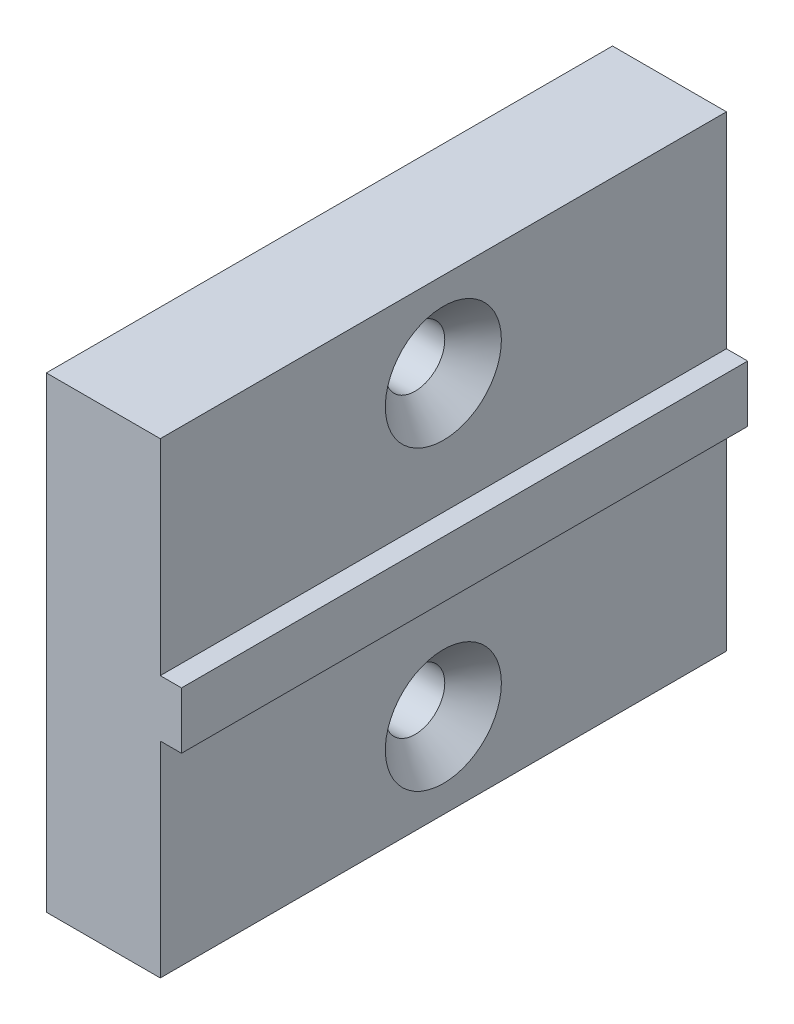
ISO-10303-21;
HEADER;
FILE_DESCRIPTION(('STEP AP214'),'2;1');
FILE_NAME('part.step','',(''),(''),'','','');
FILE_SCHEMA(('AUTOMOTIVE_DESIGN { 1 0 10303 214 1 1 1 1 }'));
ENDSEC;
DATA;
#1=APPLICATION_CONTEXT('core data for automotive mechanical design processes');
#2=APPLICATION_PROTOCOL_DEFINITION('international standard','automotive_design',2000,#1);
#3=PRODUCT_CONTEXT('',#1,'mechanical');
#4=PRODUCT('Part','Part','',(#3));
#5=PRODUCT_RELATED_PRODUCT_CATEGORY('part','',(#4));
#6=PRODUCT_DEFINITION_FORMATION('','',#4);
#7=PRODUCT_DEFINITION_CONTEXT('part definition',#1,'design');
#8=PRODUCT_DEFINITION('design','',#6,#7);
#9=PRODUCT_DEFINITION_SHAPE('','',#8);
#10=(LENGTH_UNIT() NAMED_UNIT(*) SI_UNIT(.MILLI.,.METRE.));
#11=(NAMED_UNIT(*) PLANE_ANGLE_UNIT() SI_UNIT($,.RADIAN.));
#12=(NAMED_UNIT(*) SI_UNIT($,.STERADIAN.) SOLID_ANGLE_UNIT());
#13=UNCERTAINTY_MEASURE_WITH_UNIT(LENGTH_MEASURE(1.E-05),#10,'distance_accuracy_value','');
#14=(GEOMETRIC_REPRESENTATION_CONTEXT(3) GLOBAL_UNCERTAINTY_ASSIGNED_CONTEXT((#13)) GLOBAL_UNIT_ASSIGNED_CONTEXT((#10,
#11,#12)) REPRESENTATION_CONTEXT('',''));
#15=CARTESIAN_POINT('',(0.,0.,0.));
#16=DIRECTION('',(0.,0.,1.));
#17=DIRECTION('',(1.,0.,0.));
#18=AXIS2_PLACEMENT_3D('',#15,#16,#17);
#19=CARTESIAN_POINT('',(0.,-16.5,0.));
#20=DIRECTION('',(0.,-1.,0.));
#21=DIRECTION('',(0.,0.,-1.));
#22=AXIS2_PLACEMENT_3D('',#19,#20,#21);
#23=PLANE('',#22);
#24=DIRECTION('',(0.,0.,-1.));
#25=VECTOR('',#24,1.);
#26=CARTESIAN_POINT('',(8.05,-16.5,0.));
#27=LINE('',#26,#25);
#28=CARTESIAN_POINT('',(8.05,-16.5,0.));
#29=VERTEX_POINT('',#28);
#30=CARTESIAN_POINT('',(8.05,-16.5,-40.));
#31=VERTEX_POINT('',#30);
#32=EDGE_CURVE('E136',#29,#31,#27,.T.);
#33=ORIENTED_EDGE('',*,*,#32,.F.);
#34=DIRECTION('',(1.,0.,0.));
#35=VECTOR('',#34,1.);
#36=CARTESIAN_POINT('',(0.,-16.5,0.));
#37=LINE('',#36,#35);
#38=CARTESIAN_POINT('',(0.,-16.5,0.));
#39=VERTEX_POINT('',#38);
#40=EDGE_CURVE('E162',#39,#29,#37,.T.);
#41=ORIENTED_EDGE('',*,*,#40,.F.);
#42=DIRECTION('',(0.,0.,-1.));
#43=VECTOR('',#42,1.);
#44=CARTESIAN_POINT('',(0.,-16.5,0.));
#45=LINE('',#44,#43);
#46=CARTESIAN_POINT('',(0.,-16.5,-40.));
#47=VERTEX_POINT('',#46);
#48=EDGE_CURVE('E146',#39,#47,#45,.T.);
#49=ORIENTED_EDGE('',*,*,#48,.T.);
#50=DIRECTION('',(1.,0.,0.));
#51=VECTOR('',#50,1.);
#52=CARTESIAN_POINT('',(0.,-16.5,-40.));
#53=LINE('',#52,#51);
#54=EDGE_CURVE('E158',#47,#31,#53,.T.);
#55=ORIENTED_EDGE('',*,*,#54,.T.);
#56=EDGE_LOOP('',(#33,#41,#49,#55));
#57=FACE_BOUND('',#56,.T.);
#58=ADVANCED_FACE('F35',(#57),#23,.T.);
#59=CARTESIAN_POINT('',(0.,16.5,0.));
#60=DIRECTION('',(0.,0.,1.));
#61=DIRECTION('',(1.,0.,0.));
#62=AXIS2_PLACEMENT_3D('',#59,#60,#61);
#63=PLANE('',#62);
#64=DIRECTION('',(0.,1.,0.));
#65=VECTOR('',#64,1.);
#66=CARTESIAN_POINT('',(8.05000000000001,2.,0.));
#67=LINE('',#66,#65);
#68=CARTESIAN_POINT('',(8.05000000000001,2.,0.));
#69=VERTEX_POINT('',#68);
#70=CARTESIAN_POINT('',(8.05,16.5,0.));
#71=VERTEX_POINT('',#70);
#72=EDGE_CURVE('E110',#69,#71,#67,.T.);
#73=ORIENTED_EDGE('',*,*,#72,.T.);
#74=DIRECTION('',(1.,0.,0.));
#75=VECTOR('',#74,1.);
#76=CARTESIAN_POINT('',(0.,16.5,0.));
#77=LINE('',#76,#75);
#78=CARTESIAN_POINT('',(0.,16.5,0.));
#79=VERTEX_POINT('',#78);
#80=EDGE_CURVE('E166',#79,#71,#77,.T.);
#81=ORIENTED_EDGE('',*,*,#80,.F.);
#82=DIRECTION('',(0.,-1.,0.));
#83=VECTOR('',#82,1.);
#84=CARTESIAN_POINT('',(0.,16.5,0.));
#85=LINE('',#84,#83);
#86=EDGE_CURVE('E155',#79,#39,#85,.T.);
#87=ORIENTED_EDGE('',*,*,#86,.T.);
#88=ORIENTED_EDGE('',*,*,#40,.T.);
#89=DIRECTION('',(0.,1.,0.));
#90=VECTOR('',#89,1.);
#91=CARTESIAN_POINT('',(8.05,-16.5,0.));
#92=LINE('',#91,#90);
#93=CARTESIAN_POINT('',(8.05,-2.,0.));
#94=VERTEX_POINT('',#93);
#95=EDGE_CURVE('E131',#29,#94,#92,.T.);
#96=ORIENTED_EDGE('',*,*,#95,.T.);
#97=DIRECTION('',(1.,0.,0.));
#98=VECTOR('',#97,1.);
#99=CARTESIAN_POINT('',(8.05,-2.,0.));
#100=LINE('',#99,#98);
#101=CARTESIAN_POINT('',(9.55,-2.,0.));
#102=VERTEX_POINT('',#101);
#103=EDGE_CURVE('E134',#94,#102,#100,.T.);
#104=ORIENTED_EDGE('',*,*,#103,.T.);
#105=DIRECTION('',(0.,-1.,0.));
#106=VECTOR('',#105,1.);
#107=CARTESIAN_POINT('',(9.55,16.5,0.));
#108=LINE('',#107,#106);
#109=CARTESIAN_POINT('',(9.55,2.,0.));
#110=VERTEX_POINT('',#109);
#111=EDGE_CURVE('E119',#110,#102,#108,.T.);
#112=ORIENTED_EDGE('',*,*,#111,.F.);
#113=DIRECTION('',(-1.,0.,0.));
#114=VECTOR('',#113,1.);
#115=CARTESIAN_POINT('',(9.55,2.,0.));
#116=LINE('',#115,#114);
#117=EDGE_CURVE('E50',#110,#69,#116,.T.);
#118=ORIENTED_EDGE('',*,*,#117,.T.);
#119=EDGE_LOOP('',(#73,#81,#87,#88,#96,#104,#112,#118));
#120=FACE_BOUND('',#119,.T.);
#121=ADVANCED_FACE('F117',(#120),#63,.T.);
#122=CARTESIAN_POINT('',(0.,16.5,-40.));
#123=DIRECTION('',(0.,1.,0.));
#124=DIRECTION('',(0.,0.,1.));
#125=AXIS2_PLACEMENT_3D('',#122,#123,#124);
#126=PLANE('',#125);
#127=DIRECTION('',(0.,0.,-1.));
#128=VECTOR('',#127,1.);
#129=CARTESIAN_POINT('',(8.05,16.5,0.));
#130=LINE('',#129,#128);
#131=CARTESIAN_POINT('',(8.05,16.5,-40.));
#132=VERTEX_POINT('',#131);
#133=EDGE_CURVE('E106',#71,#132,#130,.T.);
#134=ORIENTED_EDGE('',*,*,#133,.T.);
#135=DIRECTION('',(1.,0.,0.));
#136=VECTOR('',#135,1.);
#137=CARTESIAN_POINT('',(0.,16.5,-40.));
#138=LINE('',#137,#136);
#139=CARTESIAN_POINT('',(0.,16.5,-40.));
#140=VERTEX_POINT('',#139);
#141=EDGE_CURVE('E168',#140,#132,#138,.T.);
#142=ORIENTED_EDGE('',*,*,#141,.F.);
#143=DIRECTION('',(0.,0.,1.));
#144=VECTOR('',#143,1.);
#145=CARTESIAN_POINT('',(0.,16.5,-40.));
#146=LINE('',#145,#144);
#147=EDGE_CURVE('E152',#140,#79,#146,.T.);
#148=ORIENTED_EDGE('',*,*,#147,.T.);
#149=ORIENTED_EDGE('',*,*,#80,.T.);
#150=EDGE_LOOP('',(#134,#142,#148,#149));
#151=FACE_BOUND('',#150,.T.);
#152=ADVANCED_FACE('F197',(#151),#126,.T.);
#153=CARTESIAN_POINT('',(0.,-16.5,-40.));
#154=DIRECTION('',(0.,0.,-1.));
#155=DIRECTION('',(-1.,0.,0.));
#156=AXIS2_PLACEMENT_3D('',#153,#154,#155);
#157=PLANE('',#156);
#158=DIRECTION('',(0.,1.,0.));
#159=VECTOR('',#158,1.);
#160=CARTESIAN_POINT('',(8.05000000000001,2.,-40.));
#161=LINE('',#160,#159);
#162=CARTESIAN_POINT('',(8.05000000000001,2.,-40.));
#163=VERTEX_POINT('',#162);
#164=EDGE_CURVE('E120',#163,#132,#161,.T.);
#165=ORIENTED_EDGE('',*,*,#164,.F.);
#166=DIRECTION('',(-1.,0.,0.));
#167=VECTOR('',#166,1.);
#168=CARTESIAN_POINT('',(9.55,2.,-40.));
#169=LINE('',#168,#167);
#170=CARTESIAN_POINT('',(9.55,2.,-40.));
#171=VERTEX_POINT('',#170);
#172=EDGE_CURVE('E103',#171,#163,#169,.T.);
#173=ORIENTED_EDGE('',*,*,#172,.F.);
#174=DIRECTION('',(0.,1.,0.));
#175=VECTOR('',#174,1.);
#176=CARTESIAN_POINT('',(9.55,-16.5,-40.));
#177=LINE('',#176,#175);
#178=CARTESIAN_POINT('',(9.55,-2.,-40.));
#179=VERTEX_POINT('',#178);
#180=EDGE_CURVE('E142',#179,#171,#177,.T.);
#181=ORIENTED_EDGE('',*,*,#180,.F.);
#182=DIRECTION('',(1.,0.,0.));
#183=VECTOR('',#182,1.);
#184=CARTESIAN_POINT('',(8.05,-2.,-40.));
#185=LINE('',#184,#183);
#186=CARTESIAN_POINT('',(8.05,-2.,-40.));
#187=VERTEX_POINT('',#186);
#188=EDGE_CURVE('E58',#187,#179,#185,.T.);
#189=ORIENTED_EDGE('',*,*,#188,.F.);
#190=DIRECTION('',(0.,1.,0.));
#191=VECTOR('',#190,1.);
#192=CARTESIAN_POINT('',(8.05,-16.5,-40.));
#193=LINE('',#192,#191);
#194=EDGE_CURVE('E128',#31,#187,#193,.T.);
#195=ORIENTED_EDGE('',*,*,#194,.F.);
#196=ORIENTED_EDGE('',*,*,#54,.F.);
#197=DIRECTION('',(0.,1.,0.));
#198=VECTOR('',#197,1.);
#199=CARTESIAN_POINT('',(0.,-16.5,-40.));
#200=LINE('',#199,#198);
#201=EDGE_CURVE('E149',#47,#140,#200,.T.);
#202=ORIENTED_EDGE('',*,*,#201,.T.);
#203=ORIENTED_EDGE('',*,*,#141,.T.);
#204=EDGE_LOOP('',(#165,#173,#181,#189,#195,#196,#202,#203));
#205=FACE_BOUND('',#204,.T.);
#206=ADVANCED_FACE('F201',(#205),#157,.T.);
#207=CARTESIAN_POINT('',(0.,0.,0.));
#208=DIRECTION('',(1.,0.,0.));
#209=DIRECTION('',(0.,0.,-1.));
#210=AXIS2_PLACEMENT_3D('',#207,#208,#209);
#211=PLANE('',#210);
#212=CARTESIAN_POINT('',(0.,-10.5,-20.));
#213=DIRECTION('',(1.,0.,0.));
#214=DIRECTION('',(0.,0.,-1.));
#215=AXIS2_PLACEMENT_3D('',#212,#213,#214);
#216=CIRCLE('',#215,2.1);
#217=CARTESIAN_POINT('',(0.,-10.5,-22.1));
#218=VERTEX_POINT('',#217);
#219=EDGE_CURVE('E318',#218,#218,#216,.T.);
#220=ORIENTED_EDGE('',*,*,#219,.T.);
#221=EDGE_LOOP('',(#220));
#222=FACE_BOUND('',#221,.T.);
#223=CARTESIAN_POINT('',(0.,10.5,-20.));
#224=DIRECTION('',(1.,0.,0.));
#225=DIRECTION('',(0.,0.,-1.));
#226=AXIS2_PLACEMENT_3D('',#223,#224,#225);
#227=CIRCLE('',#226,2.1);
#228=CARTESIAN_POINT('',(0.,10.5,-22.1));
#229=VERTEX_POINT('',#228);
#230=EDGE_CURVE('E124',#229,#229,#227,.T.);
#231=ORIENTED_EDGE('',*,*,#230,.T.);
#232=EDGE_LOOP('',(#231));
#233=FACE_BOUND('',#232,.T.);
#234=ORIENTED_EDGE('',*,*,#48,.F.);
#235=ORIENTED_EDGE('',*,*,#86,.F.);
#236=ORIENTED_EDGE('',*,*,#147,.F.);
#237=ORIENTED_EDGE('',*,*,#201,.F.);
#238=EDGE_LOOP('',(#234,#235,#236,#237));
#239=FACE_BOUND('',#238,.T.);
#240=ADVANCED_FACE('F204',(#222,#233,#239),#211,.F.);
#241=CARTESIAN_POINT('',(9.55,0.,0.));
#242=DIRECTION('',(1.,0.,0.));
#243=DIRECTION('',(0.,0.,-1.));
#244=AXIS2_PLACEMENT_3D('',#241,#242,#243);
#245=PLANE('',#244);
#246=DIRECTION('',(0.,0.,-1.));
#247=VECTOR('',#246,1.);
#248=CARTESIAN_POINT('',(9.55,2.,0.));
#249=LINE('',#248,#247);
#250=EDGE_CURVE('E107',#110,#171,#249,.T.);
#251=ORIENTED_EDGE('',*,*,#250,.F.);
#252=ORIENTED_EDGE('',*,*,#111,.T.);
#253=DIRECTION('',(0.,0.,-1.));
#254=VECTOR('',#253,1.);
#255=CARTESIAN_POINT('',(9.55,-2.,0.));
#256=LINE('',#255,#254);
#257=EDGE_CURVE('E140',#102,#179,#256,.T.);
#258=ORIENTED_EDGE('',*,*,#257,.T.);
#259=ORIENTED_EDGE('',*,*,#180,.T.);
#260=EDGE_LOOP('',(#251,#252,#258,#259));
#261=FACE_BOUND('',#260,.T.);
#262=ADVANCED_FACE('F209',(#261),#245,.T.);
#263=CARTESIAN_POINT('',(8.05,-2.,0.));
#264=DIRECTION('',(0.,1.,0.));
#265=DIRECTION('',(0.,0.,1.));
#266=AXIS2_PLACEMENT_3D('',#263,#264,#265);
#267=PLANE('',#266);
#268=ORIENTED_EDGE('',*,*,#188,.T.);
#269=ORIENTED_EDGE('',*,*,#257,.F.);
#270=ORIENTED_EDGE('',*,*,#103,.F.);
#271=DIRECTION('',(0.,0.,-1.));
#272=VECTOR('',#271,1.);
#273=CARTESIAN_POINT('',(8.05,-2.,0.));
#274=LINE('',#273,#272);
#275=EDGE_CURVE('E143',#94,#187,#274,.T.);
#276=ORIENTED_EDGE('',*,*,#275,.T.);
#277=EDGE_LOOP('',(#268,#269,#270,#276));
#278=FACE_BOUND('',#277,.T.);
#279=ADVANCED_FACE('F212',(#278),#267,.F.);
#280=CARTESIAN_POINT('',(8.05,-16.5,0.));
#281=DIRECTION('',(-1.,0.,0.));
#282=DIRECTION('',(0.,0.,1.));
#283=AXIS2_PLACEMENT_3D('',#280,#281,#282);
#284=PLANE('',#283);
#285=CARTESIAN_POINT('',(8.05,-10.5,-20.));
#286=DIRECTION('',(-1.,0.,0.));
#287=DIRECTION('',(0.,0.,1.));
#288=AXIS2_PLACEMENT_3D('',#285,#286,#287);
#289=CIRCLE('',#288,4.09999999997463);
#290=CARTESIAN_POINT('',(8.05000000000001,-10.5,-24.0999999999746));
#291=VERTEX_POINT('',#290);
#292=EDGE_CURVE('E11',#291,#291,#289,.T.);
#293=ORIENTED_EDGE('',*,*,#292,.T.);
#294=EDGE_LOOP('',(#293));
#295=FACE_BOUND('',#294,.T.);
#296=ORIENTED_EDGE('',*,*,#194,.T.);
#297=ORIENTED_EDGE('',*,*,#275,.F.);
#298=ORIENTED_EDGE('',*,*,#95,.F.);
#299=ORIENTED_EDGE('',*,*,#32,.T.);
#300=EDGE_LOOP('',(#296,#297,#298,#299));
#301=FACE_BOUND('',#300,.T.);
#302=ADVANCED_FACE('F217',(#295,#301),#284,.F.);
#303=CARTESIAN_POINT('',(8.05000000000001,2.,0.));
#304=DIRECTION('',(-1.,0.,0.));
#305=DIRECTION('',(0.,-1.,0.));
#306=AXIS2_PLACEMENT_3D('',#303,#304,#305);
#307=PLANE('',#306);
#308=CARTESIAN_POINT('',(8.05,10.5,-20.));
#309=DIRECTION('',(-1.,0.,0.));
#310=DIRECTION('',(0.,-1.,0.));
#311=AXIS2_PLACEMENT_3D('',#308,#309,#310);
#312=CIRCLE('',#311,4.09999999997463);
#313=CARTESIAN_POINT('',(8.05,6.40000000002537,-20.));
#314=VERTEX_POINT('',#313);
#315=EDGE_CURVE('E175',#314,#314,#312,.T.);
#316=ORIENTED_EDGE('',*,*,#315,.T.);
#317=EDGE_LOOP('',(#316));
#318=FACE_BOUND('',#317,.T.);
#319=ORIENTED_EDGE('',*,*,#164,.T.);
#320=ORIENTED_EDGE('',*,*,#133,.F.);
#321=ORIENTED_EDGE('',*,*,#72,.F.);
#322=DIRECTION('',(0.,0.,-1.));
#323=VECTOR('',#322,1.);
#324=CARTESIAN_POINT('',(8.05000000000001,2.,0.));
#325=LINE('',#324,#323);
#326=EDGE_CURVE('E99',#69,#163,#325,.T.);
#327=ORIENTED_EDGE('',*,*,#326,.T.);
#328=EDGE_LOOP('',(#319,#320,#321,#327));
#329=FACE_BOUND('',#328,.T.);
#330=ADVANCED_FACE('F111',(#318,#329),#307,.F.);
#331=CARTESIAN_POINT('',(9.55,2.,0.));
#332=DIRECTION('',(0.,-1.,0.));
#333=DIRECTION('',(1.,0.,0.));
#334=AXIS2_PLACEMENT_3D('',#331,#332,#333);
#335=PLANE('',#334);
#336=ORIENTED_EDGE('',*,*,#172,.T.);
#337=ORIENTED_EDGE('',*,*,#326,.F.);
#338=ORIENTED_EDGE('',*,*,#117,.F.);
#339=ORIENTED_EDGE('',*,*,#250,.T.);
#340=EDGE_LOOP('',(#336,#337,#338,#339));
#341=FACE_BOUND('',#340,.T.);
#342=ADVANCED_FACE('F101',(#341),#335,.F.);
#343=CARTESIAN_POINT('',(8.05,10.5,-20.));
#344=DIRECTION('',(1.,0.,0.));
#345=DIRECTION('',(0.,0.,-1.));
#346=AXIS2_PLACEMENT_3D('',#343,#344,#345);
#347=CYLINDRICAL_SURFACE('',#346,2.1);
#348=CARTESIAN_POINT('',(6.05000000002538,10.5,-20.));
#349=DIRECTION('',(-1.,0.,0.));
#350=DIRECTION('',(0.,0.,1.));
#351=AXIS2_PLACEMENT_3D('',#348,#349,#350);
#352=CIRCLE('',#351,2.1);
#353=CARTESIAN_POINT('',(6.05000000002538,10.5,-17.9));
#354=VERTEX_POINT('',#353);
#355=EDGE_CURVE('E165',#354,#354,#352,.F.);
#356=ORIENTED_EDGE('',*,*,#355,.T.);
#357=EDGE_LOOP('',(#356));
#358=FACE_BOUND('',#357,.T.);
#359=ORIENTED_EDGE('',*,*,#230,.F.);
#360=EDGE_LOOP('',(#359));
#361=FACE_BOUND('',#360,.T.);
#362=ADVANCED_FACE('F225',(#358,#361),#347,.F.);
#363=CARTESIAN_POINT('',(8.05,-10.5,-20.));
#364=DIRECTION('',(1.,0.,0.));
#365=DIRECTION('',(0.,0.,-1.));
#366=AXIS2_PLACEMENT_3D('',#363,#364,#365);
#367=CYLINDRICAL_SURFACE('',#366,2.1);
#368=CARTESIAN_POINT('',(6.05000000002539,-10.5,-20.));
#369=DIRECTION('',(-1.,0.,0.));
#370=DIRECTION('',(0.,0.,1.));
#371=AXIS2_PLACEMENT_3D('',#368,#369,#370);
#372=CIRCLE('',#371,2.1);
#373=CARTESIAN_POINT('',(6.05000000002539,-10.5,-22.1));
#374=VERTEX_POINT('',#373);
#375=EDGE_CURVE('E43',#374,#374,#372,.F.);
#376=ORIENTED_EDGE('',*,*,#375,.T.);
#377=EDGE_LOOP('',(#376));
#378=FACE_BOUND('',#377,.T.);
#379=ORIENTED_EDGE('',*,*,#219,.F.);
#380=EDGE_LOOP('',(#379));
#381=FACE_BOUND('',#380,.T.);
#382=ADVANCED_FACE('F180',(#378,#381),#367,.F.);
#383=CARTESIAN_POINT('',(6.05000000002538,10.5,-20.));
#384=DIRECTION('',(1.,0.,0.));
#385=DIRECTION('',(0.,0.,-1.));
#386=AXIS2_PLACEMENT_3D('',#383,#384,#385);
#387=CONICAL_SURFACE('',#386,2.1,0.785398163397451);
#388=ORIENTED_EDGE('',*,*,#315,.F.);
#389=EDGE_LOOP('',(#388));
#390=FACE_BOUND('',#389,.T.);
#391=ORIENTED_EDGE('',*,*,#355,.F.);
#392=EDGE_LOOP('',(#391));
#393=FACE_BOUND('',#392,.T.);
#394=ADVANCED_FACE('F184',(#390,#393),#387,.F.);
#395=CARTESIAN_POINT('',(6.05000000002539,-10.5,-20.));
#396=DIRECTION('',(1.,0.,0.));
#397=DIRECTION('',(0.,0.,-1.));
#398=AXIS2_PLACEMENT_3D('',#395,#396,#397);
#399=CONICAL_SURFACE('',#398,2.1,0.785398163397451);
#400=CARTESIAN_POINT('',(8.05000000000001,-10.5,-24.0999999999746));
#401=CARTESIAN_POINT('',(8.02916666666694,-10.5,-24.0791666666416));
#402=CARTESIAN_POINT('',(8.00833333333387,-10.5,-24.0583333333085));
#403=CARTESIAN_POINT('',(7.96666666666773,-10.5,-24.0166666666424));
#404=CARTESIAN_POINT('',(7.94583333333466,-10.5,-23.9958333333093));
#405=CARTESIAN_POINT('',(7.90416666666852,-10.5,-23.9541666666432));
#406=CARTESIAN_POINT('',(7.88333333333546,-10.5,-23.9333333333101));
#407=CARTESIAN_POINT('',(7.84166666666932,-10.5,-23.8916666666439));
#408=CARTESIAN_POINT('',(7.82083333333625,-10.5,-23.8708333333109));
#409=CARTESIAN_POINT('',(7.77916666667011,-10.5,-23.8291666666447));
#410=CARTESIAN_POINT('',(7.75833333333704,-10.5,-23.8083333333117));
#411=CARTESIAN_POINT('',(7.7166666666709,-10.5,-23.7666666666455));
#412=CARTESIAN_POINT('',(7.69583333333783,-10.5,-23.7458333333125));
#413=CARTESIAN_POINT('',(7.6541666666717,-10.5,-23.7041666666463));
#414=CARTESIAN_POINT('',(7.63333333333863,-10.5,-23.6833333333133));
#415=CARTESIAN_POINT('',(7.59166666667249,-10.5,-23.6416666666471));
#416=CARTESIAN_POINT('',(7.57083333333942,-10.5,-23.620833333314));
#417=CARTESIAN_POINT('',(7.52916666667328,-10.5,-23.5791666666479));
#418=CARTESIAN_POINT('',(7.50833333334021,-10.5,-23.5583333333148));
#419=CARTESIAN_POINT('',(7.46666666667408,-10.5,-23.5166666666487));
#420=CARTESIAN_POINT('',(7.44583333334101,-10.5,-23.4958333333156));
#421=CARTESIAN_POINT('',(7.40416666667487,-10.5,-23.4541666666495));
#422=CARTESIAN_POINT('',(7.3833333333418,-10.5,-23.4333333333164));
#423=CARTESIAN_POINT('',(7.34166666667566,-10.5,-23.3916666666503));
#424=CARTESIAN_POINT('',(7.32083333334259,-10.5,-23.3708333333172));
#425=CARTESIAN_POINT('',(7.27916666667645,-10.5,-23.3291666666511));
#426=CARTESIAN_POINT('',(7.25833333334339,-10.5,-23.308333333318));
#427=CARTESIAN_POINT('',(7.21666666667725,-10.5,-23.2666666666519));
#428=CARTESIAN_POINT('',(7.19583333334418,-10.5,-23.2458333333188));
#429=CARTESIAN_POINT('',(7.15416666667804,-10.5,-23.2041666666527));
#430=CARTESIAN_POINT('',(7.13333333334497,-10.5,-23.1833333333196));
#431=CARTESIAN_POINT('',(7.09166666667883,-10.5,-23.1416666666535));
#432=CARTESIAN_POINT('',(7.07083333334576,-10.5,-23.1208333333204));
#433=CARTESIAN_POINT('',(7.02916666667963,-10.5,-23.0791666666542));
#434=CARTESIAN_POINT('',(7.00833333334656,-10.5,-23.0583333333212));
#435=CARTESIAN_POINT('',(6.96666666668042,-10.5,-23.016666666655));
#436=CARTESIAN_POINT('',(6.94583333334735,-10.5,-22.995833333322));
#437=CARTESIAN_POINT('',(6.90416666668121,-10.5,-22.9541666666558));
#438=CARTESIAN_POINT('',(6.88333333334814,-10.5,-22.9333333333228));
#439=CARTESIAN_POINT('',(6.84166666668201,-10.5,-22.8916666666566));
#440=CARTESIAN_POINT('',(6.82083333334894,-10.5,-22.8708333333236));
#441=CARTESIAN_POINT('',(6.7791666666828,-10.5,-22.8291666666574));
#442=CARTESIAN_POINT('',(6.75833333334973,-10.5,-22.8083333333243));
#443=CARTESIAN_POINT('',(6.71666666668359,-10.5,-22.7666666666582));
#444=CARTESIAN_POINT('',(6.69583333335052,-10.5,-22.7458333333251));
#445=CARTESIAN_POINT('',(6.65416666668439,-10.5,-22.704166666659));
#446=CARTESIAN_POINT('',(6.63333333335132,-10.5,-22.6833333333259));
#447=CARTESIAN_POINT('',(6.59166666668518,-10.5,-22.6416666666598));
#448=CARTESIAN_POINT('',(6.57083333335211,-10.5,-22.6208333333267));
#449=CARTESIAN_POINT('',(6.52916666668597,-10.5,-22.5791666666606));
#450=CARTESIAN_POINT('',(6.5083333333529,-10.5,-22.5583333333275));
#451=CARTESIAN_POINT('',(6.46666666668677,-10.5,-22.5166666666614));
#452=CARTESIAN_POINT('',(6.4458333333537,-10.5,-22.4958333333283));
#453=CARTESIAN_POINT('',(6.40416666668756,-10.5,-22.4541666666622));
#454=CARTESIAN_POINT('',(6.38333333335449,-10.5,-22.4333333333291));
#455=CARTESIAN_POINT('',(6.34166666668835,-10.5,-22.391666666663));
#456=CARTESIAN_POINT('',(6.32083333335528,-10.5,-22.3708333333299));
#457=CARTESIAN_POINT('',(6.27916666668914,-10.5,-22.3291666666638));
#458=CARTESIAN_POINT('',(6.25833333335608,-10.5,-22.3083333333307));
#459=CARTESIAN_POINT('',(6.21666666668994,-10.5,-22.2666666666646));
#460=CARTESIAN_POINT('',(6.19583333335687,-10.5,-22.2458333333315));
#461=CARTESIAN_POINT('',(6.15416666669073,-10.5,-22.2041666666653));
#462=CARTESIAN_POINT('',(6.13333333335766,-10.5,-22.1833333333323));
#463=CARTESIAN_POINT('',(6.09166666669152,-10.5,-22.1416666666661));
#464=CARTESIAN_POINT('',(6.07083333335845,-10.5,-22.1208333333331));
#465=CARTESIAN_POINT('',(6.05000000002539,-10.5,-22.1));
#466=B_SPLINE_CURVE_WITH_KNOTS('',3,(#400,#401,#402,#403,#404,#405,#406,#407,#408,#409,#410,
#411,#412,#413,#414,#415,#416,#417,#418,#419,#420,#421,#422,#423,#424,#425,#426,#427,#428,#429,
#430,#431,#432,#433,#434,#435,#436,#437,#438,#439,#440,#441,#442,#443,#444,#445,#446,#447,#448,
#449,#450,#451,#452,#453,#454,#455,#456,#457,#458,#459,#460,#461,#462,#463,#464,#465),
.UNSPECIFIED.,.F.,.F.,(4,2,2,2,2,2,2,2,2,2,2,2,2,2,2,2,2,2,2,2,2,2,2,2,2,2,2,2,2,2,2,2,4),(0.,
0.0883883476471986,0.176776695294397,0.265165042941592,0.353553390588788,0.441941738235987,
0.530330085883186,0.618718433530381,0.707106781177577,0.795495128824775,0.883883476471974,
0.972271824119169,1.06066017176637,1.14904851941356,1.23743686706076,1.32582521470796,
1.41421356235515,1.50260191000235,1.59099025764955,1.67937860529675,1.76776695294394,
1.85615530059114,1.94454364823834,2.03293199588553,2.12132034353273,2.20970869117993,
2.29809703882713,2.38648538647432,2.47487373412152,2.56326208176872,2.65165042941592,
2.74003877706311,2.82842712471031),.UNSPECIFIED.);
#467=EDGE_CURVE('BSEAM37',#291,#374,#466,.T.);
#468=ORIENTED_EDGE('',*,*,#292,.F.);
#469=ORIENTED_EDGE('',*,*,#375,.F.);
#470=ORIENTED_EDGE('',*,*,#467,.T.);
#471=ORIENTED_EDGE('',*,*,#467,.F.);
#472=EDGE_LOOP('',(#468,#470,#469,#471));
#473=FACE_BOUND('',#472,.T.);
#474=ADVANCED_FACE('F37',(#473),#399,.F.);
#475=CLOSED_SHELL('',(#58,#121,#152,#206,#240,#262,#279,#302,#330,#342,#362,#382,#394,#474));
#476=MANIFOLD_SOLID_BREP('B2',#475);
#477=ADVANCED_BREP_SHAPE_REPRESENTATION('',(#18,#476),#14);
#478=SHAPE_DEFINITION_REPRESENTATION(#9,#477);
ENDSEC;
END-ISO-10303-21;
